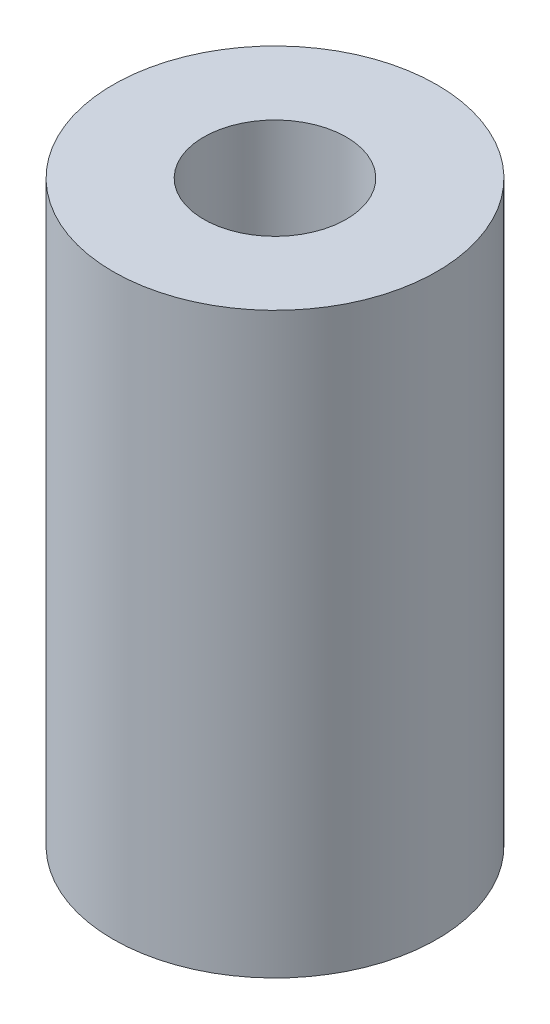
ISO-10303-21;
HEADER;
FILE_DESCRIPTION(('STEP AP214'),'2;1');
FILE_NAME('part.step','',(''),(''),'','','');
FILE_SCHEMA(('AUTOMOTIVE_DESIGN { 1 0 10303 214 1 1 1 1 }'));
ENDSEC;
DATA;
#1=APPLICATION_CONTEXT('core data for automotive mechanical design processes');
#2=APPLICATION_PROTOCOL_DEFINITION('international standard','automotive_design',2000,#1);
#3=PRODUCT_CONTEXT('',#1,'mechanical');
#4=PRODUCT('Part','Part','',(#3));
#5=PRODUCT_RELATED_PRODUCT_CATEGORY('part','',(#4));
#6=PRODUCT_DEFINITION_FORMATION('','',#4);
#7=PRODUCT_DEFINITION_CONTEXT('part definition',#1,'design');
#8=PRODUCT_DEFINITION('design','',#6,#7);
#9=PRODUCT_DEFINITION_SHAPE('','',#8);
#10=(LENGTH_UNIT() NAMED_UNIT(*) SI_UNIT(.MILLI.,.METRE.));
#11=(NAMED_UNIT(*) PLANE_ANGLE_UNIT() SI_UNIT($,.RADIAN.));
#12=(NAMED_UNIT(*) SI_UNIT($,.STERADIAN.) SOLID_ANGLE_UNIT());
#13=UNCERTAINTY_MEASURE_WITH_UNIT(LENGTH_MEASURE(1.E-05),#10,'distance_accuracy_value','');
#14=(GEOMETRIC_REPRESENTATION_CONTEXT(3) GLOBAL_UNCERTAINTY_ASSIGNED_CONTEXT((#13)) GLOBAL_UNIT_ASSIGNED_CONTEXT((#10,
#11,#12)) REPRESENTATION_CONTEXT('',''));
#15=CARTESIAN_POINT('',(0.,0.,0.));
#16=DIRECTION('',(0.,0.,1.));
#17=DIRECTION('',(1.,0.,0.));
#18=AXIS2_PLACEMENT_3D('',#15,#16,#17);
#19=CARTESIAN_POINT('',(0.,19.05,0.));
#20=DIRECTION('',(0.,1.,0.));
#21=DIRECTION('',(0.,0.,1.));
#22=AXIS2_PLACEMENT_3D('',#19,#20,#21);
#23=PLANE('',#22);
#24=CARTESIAN_POINT('',(0.,19.05,0.));
#25=DIRECTION('',(0.,1.,0.));
#26=DIRECTION('',(0.,0.,1.));
#27=AXIS2_PLACEMENT_3D('',#24,#25,#26);
#28=CIRCLE('',#27,5.334);
#29=CARTESIAN_POINT('',(0.,19.05,-5.334));
#30=VERTEX_POINT('',#29);
#31=EDGE_CURVE('E10',#30,#30,#28,.T.);
#32=ORIENTED_EDGE('',*,*,#31,.T.);
#33=EDGE_LOOP('',(#32));
#34=FACE_BOUND('',#33,.T.);
#35=CARTESIAN_POINT('',(0.,19.05,0.));
#36=DIRECTION('',(0.,1.,0.));
#37=DIRECTION('',(0.,0.,1.));
#38=AXIS2_PLACEMENT_3D('',#35,#36,#37);
#39=CIRCLE('',#38,2.3495);
#40=CARTESIAN_POINT('',(0.,19.05,-2.3495));
#41=VERTEX_POINT('',#40);
#42=EDGE_CURVE('E43',#41,#41,#39,.T.);
#43=ORIENTED_EDGE('',*,*,#42,.F.);
#44=EDGE_LOOP('',(#43));
#45=FACE_BOUND('',#44,.T.);
#46=ADVANCED_FACE('F32',(#34,#45),#23,.T.);
#47=CARTESIAN_POINT('',(0.,0.,0.));
#48=DIRECTION('',(0.,1.,0.));
#49=DIRECTION('',(0.,0.,1.));
#50=AXIS2_PLACEMENT_3D('',#47,#48,#49);
#51=PLANE('',#50);
#52=CARTESIAN_POINT('',(0.,0.,0.));
#53=DIRECTION('',(0.,1.,0.));
#54=DIRECTION('',(0.,0.,1.));
#55=AXIS2_PLACEMENT_3D('',#52,#53,#54);
#56=CIRCLE('',#55,5.334);
#57=CARTESIAN_POINT('',(0.,0.,-5.334));
#58=VERTEX_POINT('',#57);
#59=EDGE_CURVE('E36',#58,#58,#56,.T.);
#60=ORIENTED_EDGE('',*,*,#59,.F.);
#61=EDGE_LOOP('',(#60));
#62=FACE_BOUND('',#61,.T.);
#63=CARTESIAN_POINT('',(0.,0.,0.));
#64=DIRECTION('',(0.,1.,0.));
#65=DIRECTION('',(0.,0.,1.));
#66=AXIS2_PLACEMENT_3D('',#63,#64,#65);
#67=CIRCLE('',#66,2.3495);
#68=CARTESIAN_POINT('',(0.,0.,-2.3495));
#69=VERTEX_POINT('',#68);
#70=EDGE_CURVE('E45',#69,#69,#67,.T.);
#71=ORIENTED_EDGE('',*,*,#70,.T.);
#72=EDGE_LOOP('',(#71));
#73=FACE_BOUND('',#72,.T.);
#74=ADVANCED_FACE('F55',(#62,#73),#51,.F.);
#75=CARTESIAN_POINT('',(0.,19.05,0.));
#76=DIRECTION('',(0.,-1.,0.));
#77=DIRECTION('',(0.,0.,-1.));
#78=AXIS2_PLACEMENT_3D('',#75,#76,#77);
#79=CYLINDRICAL_SURFACE('',#78,5.334);
#80=CARTESIAN_POINT('',(0.,19.05,-5.334));
#81=CARTESIAN_POINT('',(0.,18.8515625,-5.334));
#82=CARTESIAN_POINT('',(0.,18.653125,-5.334));
#83=CARTESIAN_POINT('',(0.,18.25625,-5.334));
#84=CARTESIAN_POINT('',(0.,18.0578125,-5.334));
#85=CARTESIAN_POINT('',(0.,17.6609375,-5.334));
#86=CARTESIAN_POINT('',(0.,17.4625,-5.334));
#87=CARTESIAN_POINT('',(0.,17.065625,-5.334));
#88=CARTESIAN_POINT('',(0.,16.8671875,-5.334));
#89=CARTESIAN_POINT('',(0.,16.4703125,-5.334));
#90=CARTESIAN_POINT('',(0.,16.271875,-5.334));
#91=CARTESIAN_POINT('',(0.,15.875,-5.334));
#92=CARTESIAN_POINT('',(0.,15.6765625,-5.334));
#93=CARTESIAN_POINT('',(0.,15.2796875,-5.334));
#94=CARTESIAN_POINT('',(0.,15.08125,-5.334));
#95=CARTESIAN_POINT('',(0.,14.684375,-5.334));
#96=CARTESIAN_POINT('',(0.,14.4859375,-5.334));
#97=CARTESIAN_POINT('',(0.,14.0890625,-5.334));
#98=CARTESIAN_POINT('',(0.,13.890625,-5.334));
#99=CARTESIAN_POINT('',(0.,13.49375,-5.334));
#100=CARTESIAN_POINT('',(0.,13.2953125,-5.334));
#101=CARTESIAN_POINT('',(0.,12.8984375,-5.334));
#102=CARTESIAN_POINT('',(0.,12.7,-5.334));
#103=CARTESIAN_POINT('',(0.,12.303125,-5.334));
#104=CARTESIAN_POINT('',(0.,12.1046875,-5.334));
#105=CARTESIAN_POINT('',(0.,11.7078125,-5.334));
#106=CARTESIAN_POINT('',(0.,11.509375,-5.334));
#107=CARTESIAN_POINT('',(0.,11.1125,-5.334));
#108=CARTESIAN_POINT('',(0.,10.9140625,-5.334));
#109=CARTESIAN_POINT('',(0.,10.5171875,-5.334));
#110=CARTESIAN_POINT('',(0.,10.31875,-5.334));
#111=CARTESIAN_POINT('',(0.,9.921875,-5.334));
#112=CARTESIAN_POINT('',(0.,9.7234375,-5.334));
#113=CARTESIAN_POINT('',(0.,9.3265625,-5.334));
#114=CARTESIAN_POINT('',(0.,9.128125,-5.334));
#115=CARTESIAN_POINT('',(0.,8.73125,-5.334));
#116=CARTESIAN_POINT('',(0.,8.5328125,-5.334));
#117=CARTESIAN_POINT('',(0.,8.1359375,-5.334));
#118=CARTESIAN_POINT('',(0.,7.9375,-5.334));
#119=CARTESIAN_POINT('',(0.,7.540625,-5.334));
#120=CARTESIAN_POINT('',(0.,7.3421875,-5.334));
#121=CARTESIAN_POINT('',(0.,6.9453125,-5.334));
#122=CARTESIAN_POINT('',(0.,6.746875,-5.334));
#123=CARTESIAN_POINT('',(0.,6.35,-5.334));
#124=CARTESIAN_POINT('',(0.,6.1515625,-5.334));
#125=CARTESIAN_POINT('',(0.,5.7546875,-5.334));
#126=CARTESIAN_POINT('',(0.,5.55625,-5.334));
#127=CARTESIAN_POINT('',(0.,5.159375,-5.334));
#128=CARTESIAN_POINT('',(0.,4.9609375,-5.334));
#129=CARTESIAN_POINT('',(0.,4.5640625,-5.334));
#130=CARTESIAN_POINT('',(0.,4.365625,-5.334));
#131=CARTESIAN_POINT('',(0.,3.96875,-5.334));
#132=CARTESIAN_POINT('',(0.,3.7703125,-5.334));
#133=CARTESIAN_POINT('',(0.,3.3734375,-5.334));
#134=CARTESIAN_POINT('',(0.,3.175,-5.334));
#135=CARTESIAN_POINT('',(0.,2.778125,-5.334));
#136=CARTESIAN_POINT('',(0.,2.5796875,-5.334));
#137=CARTESIAN_POINT('',(0.,2.1828125,-5.334));
#138=CARTESIAN_POINT('',(0.,1.984375,-5.334));
#139=CARTESIAN_POINT('',(0.,1.5875,-5.334));
#140=CARTESIAN_POINT('',(0.,1.3890625,-5.334));
#141=CARTESIAN_POINT('',(0.,0.992187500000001,-5.334));
#142=CARTESIAN_POINT('',(0.,0.793750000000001,-5.334));
#143=CARTESIAN_POINT('',(0.,0.396875,-5.334));
#144=CARTESIAN_POINT('',(0.,0.1984375,-5.334));
#145=CARTESIAN_POINT('',(0.,0.,-5.334));
#146=B_SPLINE_CURVE_WITH_KNOTS('',3,(#80,#81,#82,#83,#84,#85,#86,#87,#88,#89,#90,#91,#92,#93,
#94,#95,#96,#97,#98,#99,#100,#101,#102,#103,#104,#105,#106,#107,#108,#109,#110,#111,#112,#113,
#114,#115,#116,#117,#118,#119,#120,#121,#122,#123,#124,#125,#126,#127,#128,#129,#130,#131,#132,
#133,#134,#135,#136,#137,#138,#139,#140,#141,#142,#143,#144,#145),.UNSPECIFIED.,.F.,.F.,(4,2,2,
2,2,2,2,2,2,2,2,2,2,2,2,2,2,2,2,2,2,2,2,2,2,2,2,2,2,2,2,2,4),(0.,0.5953125,1.190625,1.7859375,
2.38125,2.9765625,3.571875,4.1671875,4.7625,5.3578125,5.953125,6.5484375,7.14375,7.7390625,
8.334375,8.9296875,9.525,10.1203125,10.715625,11.3109375,11.90625,12.5015625,13.096875,
13.6921875,14.2875,14.8828125,15.478125,16.0734375,16.66875,17.2640625,17.859375,18.4546875,
19.05),.UNSPECIFIED.);
#147=EDGE_CURVE('BSEAM34',#30,#58,#146,.T.);
#148=ORIENTED_EDGE('',*,*,#31,.F.);
#149=ORIENTED_EDGE('',*,*,#59,.T.);
#150=ORIENTED_EDGE('',*,*,#147,.T.);
#151=ORIENTED_EDGE('',*,*,#147,.F.);
#152=EDGE_LOOP('',(#148,#150,#149,#151));
#153=FACE_BOUND('',#152,.T.);
#154=ADVANCED_FACE('F34',(#153),#79,.T.);
#155=CARTESIAN_POINT('',(0.,19.05,0.));
#156=DIRECTION('',(0.,-1.,0.));
#157=DIRECTION('',(0.,0.,-1.));
#158=AXIS2_PLACEMENT_3D('',#155,#156,#157);
#159=CYLINDRICAL_SURFACE('',#158,2.3495);
#160=CARTESIAN_POINT('',(0.,19.05,-2.3495));
#161=CARTESIAN_POINT('',(0.,18.8515625,-2.3495));
#162=CARTESIAN_POINT('',(0.,18.653125,-2.3495));
#163=CARTESIAN_POINT('',(0.,18.25625,-2.3495));
#164=CARTESIAN_POINT('',(0.,18.0578125,-2.3495));
#165=CARTESIAN_POINT('',(0.,17.6609375,-2.3495));
#166=CARTESIAN_POINT('',(0.,17.4625,-2.3495));
#167=CARTESIAN_POINT('',(0.,17.065625,-2.3495));
#168=CARTESIAN_POINT('',(0.,16.8671875,-2.3495));
#169=CARTESIAN_POINT('',(0.,16.4703125,-2.3495));
#170=CARTESIAN_POINT('',(0.,16.271875,-2.3495));
#171=CARTESIAN_POINT('',(0.,15.875,-2.3495));
#172=CARTESIAN_POINT('',(0.,15.6765625,-2.3495));
#173=CARTESIAN_POINT('',(0.,15.2796875,-2.3495));
#174=CARTESIAN_POINT('',(0.,15.08125,-2.3495));
#175=CARTESIAN_POINT('',(0.,14.684375,-2.3495));
#176=CARTESIAN_POINT('',(0.,14.4859375,-2.3495));
#177=CARTESIAN_POINT('',(0.,14.0890625,-2.3495));
#178=CARTESIAN_POINT('',(0.,13.890625,-2.3495));
#179=CARTESIAN_POINT('',(0.,13.49375,-2.3495));
#180=CARTESIAN_POINT('',(0.,13.2953125,-2.3495));
#181=CARTESIAN_POINT('',(0.,12.8984375,-2.3495));
#182=CARTESIAN_POINT('',(0.,12.7,-2.3495));
#183=CARTESIAN_POINT('',(0.,12.303125,-2.3495));
#184=CARTESIAN_POINT('',(0.,12.1046875,-2.3495));
#185=CARTESIAN_POINT('',(0.,11.7078125,-2.3495));
#186=CARTESIAN_POINT('',(0.,11.509375,-2.3495));
#187=CARTESIAN_POINT('',(0.,11.1125,-2.3495));
#188=CARTESIAN_POINT('',(0.,10.9140625,-2.3495));
#189=CARTESIAN_POINT('',(0.,10.5171875,-2.3495));
#190=CARTESIAN_POINT('',(0.,10.31875,-2.3495));
#191=CARTESIAN_POINT('',(0.,9.921875,-2.3495));
#192=CARTESIAN_POINT('',(0.,9.7234375,-2.3495));
#193=CARTESIAN_POINT('',(0.,9.3265625,-2.3495));
#194=CARTESIAN_POINT('',(0.,9.128125,-2.3495));
#195=CARTESIAN_POINT('',(0.,8.73125,-2.3495));
#196=CARTESIAN_POINT('',(0.,8.5328125,-2.3495));
#197=CARTESIAN_POINT('',(0.,8.1359375,-2.3495));
#198=CARTESIAN_POINT('',(0.,7.9375,-2.3495));
#199=CARTESIAN_POINT('',(0.,7.540625,-2.3495));
#200=CARTESIAN_POINT('',(0.,7.3421875,-2.3495));
#201=CARTESIAN_POINT('',(0.,6.9453125,-2.3495));
#202=CARTESIAN_POINT('',(0.,6.746875,-2.3495));
#203=CARTESIAN_POINT('',(0.,6.35,-2.3495));
#204=CARTESIAN_POINT('',(0.,6.1515625,-2.3495));
#205=CARTESIAN_POINT('',(0.,5.7546875,-2.3495));
#206=CARTESIAN_POINT('',(0.,5.55625,-2.3495));
#207=CARTESIAN_POINT('',(0.,5.159375,-2.3495));
#208=CARTESIAN_POINT('',(0.,4.9609375,-2.3495));
#209=CARTESIAN_POINT('',(0.,4.5640625,-2.3495));
#210=CARTESIAN_POINT('',(0.,4.365625,-2.3495));
#211=CARTESIAN_POINT('',(0.,3.96875,-2.3495));
#212=CARTESIAN_POINT('',(0.,3.7703125,-2.3495));
#213=CARTESIAN_POINT('',(0.,3.3734375,-2.3495));
#214=CARTESIAN_POINT('',(0.,3.175,-2.3495));
#215=CARTESIAN_POINT('',(0.,2.778125,-2.3495));
#216=CARTESIAN_POINT('',(0.,2.5796875,-2.3495));
#217=CARTESIAN_POINT('',(0.,2.1828125,-2.3495));
#218=CARTESIAN_POINT('',(0.,1.984375,-2.3495));
#219=CARTESIAN_POINT('',(0.,1.5875,-2.3495));
#220=CARTESIAN_POINT('',(0.,1.3890625,-2.3495));
#221=CARTESIAN_POINT('',(0.,0.992187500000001,-2.3495));
#222=CARTESIAN_POINT('',(0.,0.793750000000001,-2.3495));
#223=CARTESIAN_POINT('',(0.,0.396875,-2.3495));
#224=CARTESIAN_POINT('',(0.,0.1984375,-2.3495));
#225=CARTESIAN_POINT('',(0.,0.,-2.3495));
#226=B_SPLINE_CURVE_WITH_KNOTS('',3,(#160,#161,#162,#163,#164,#165,#166,#167,#168,#169,#170,
#171,#172,#173,#174,#175,#176,#177,#178,#179,#180,#181,#182,#183,#184,#185,#186,#187,#188,#189,
#190,#191,#192,#193,#194,#195,#196,#197,#198,#199,#200,#201,#202,#203,#204,#205,#206,#207,#208,
#209,#210,#211,#212,#213,#214,#215,#216,#217,#218,#219,#220,#221,#222,#223,#224,#225),
.UNSPECIFIED.,.F.,.F.,(4,2,2,2,2,2,2,2,2,2,2,2,2,2,2,2,2,2,2,2,2,2,2,2,2,2,2,2,2,2,2,2,4),(0.,
0.5953125,1.190625,1.7859375,2.38125,2.9765625,3.571875,4.1671875,4.7625,5.3578125,5.953125,
6.5484375,7.14375,7.7390625,8.334375,8.9296875,9.525,10.1203125,10.715625,11.3109375,11.90625,
12.5015625,13.096875,13.6921875,14.2875,14.8828125,15.478125,16.0734375,16.66875,17.2640625,
17.859375,18.4546875,19.05),.UNSPECIFIED.);
#227=EDGE_CURVE('BSEAM51',#41,#69,#226,.T.);
#228=ORIENTED_EDGE('',*,*,#42,.T.);
#229=ORIENTED_EDGE('',*,*,#70,.F.);
#230=ORIENTED_EDGE('',*,*,#227,.T.);
#231=ORIENTED_EDGE('',*,*,#227,.F.);
#232=EDGE_LOOP('',(#228,#230,#229,#231));
#233=FACE_BOUND('',#232,.T.);
#234=ADVANCED_FACE('F51',(#233),#159,.F.);
#235=CLOSED_SHELL('',(#46,#74,#154,#234));
#236=MANIFOLD_SOLID_BREP('B2',#235);
#237=ADVANCED_BREP_SHAPE_REPRESENTATION('',(#18,#236),#14);
#238=SHAPE_DEFINITION_REPRESENTATION(#9,#237);
ENDSEC;
END-ISO-10303-21;
